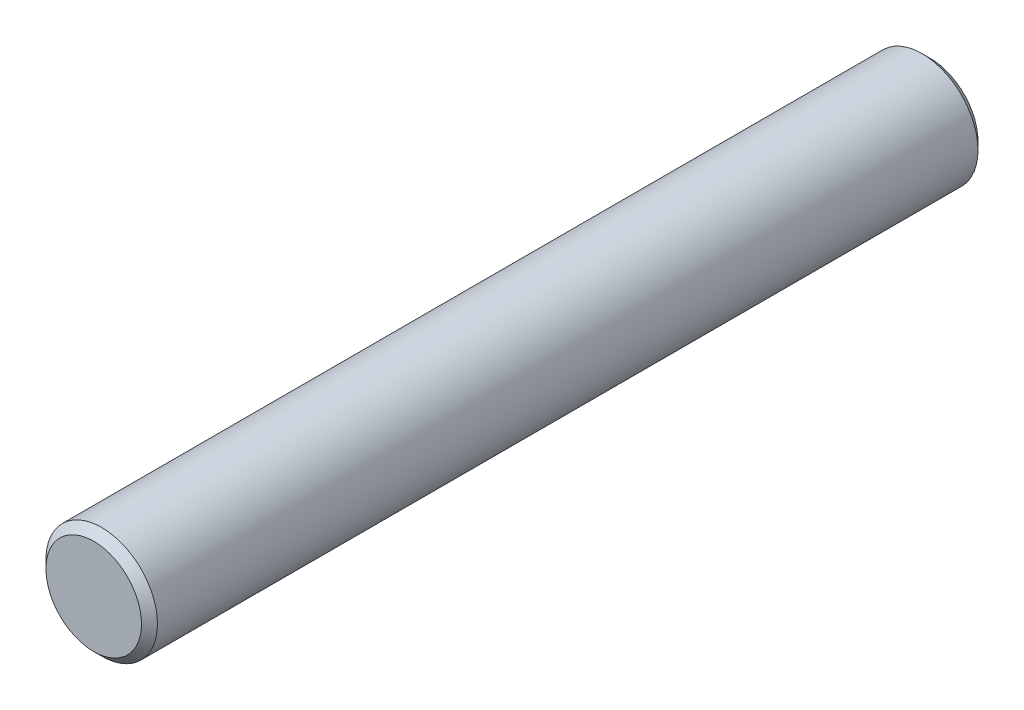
from build123d import *

# Parameters (mm, degrees)
ESQUISSE1_R          = 14
BASE_EXTRUSION_DEPTH = 210
CHANFREIN1_SIZE      = 2


with BuildPart() as part:
    # Esquisse1 → Base-Extrusion (new body)
    with BuildSketch(Plane.XY):
        Circle(ESQUISSE1_R)
    extrude(amount=BASE_EXTRUSION_DEPTH)

    # Chanfrein1
    chanfrein1_edges = [part.edges().sort_by_distance(p)[0] for p in [
        (-14, 0, 0),
        (-14, 0, 210),
    ]]
    chamfer(chanfrein1_edges, length=CHANFREIN1_SIZE)


solid = part.part
